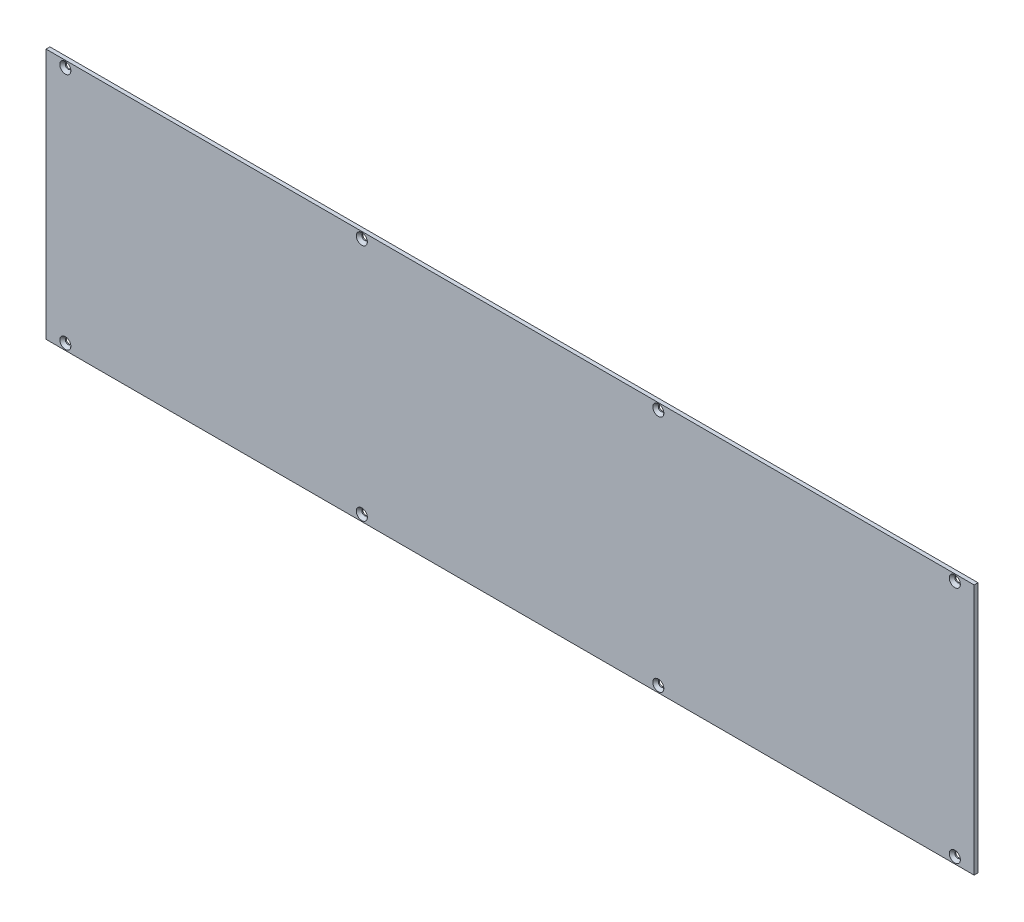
from build123d import *

# Parameters (mm, degrees)
SKETCH_1_W          = 720
SKETCH_1_H          = 195
EXTRUDE_1_DEPTH     = 3
SKETCH_2_R          = 4.3
CUT_EXTRUDE_1_DEPTH = 2.15
DRAFT_1_ANGLE       = 45
SKETCH_3_R          = 2.15
CUT_EXTRUDE_2_DEPTH = 746.942103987
SKETCH_4_R          = 2.15
CUT_EXTRUDE_3_DEPTH = 746.942103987
SKETCH_5_R          = 2.15
CUT_EXTRUDE_4_DEPTH = 746.942103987
SKETCH_6_R          = 2.15
CUT_EXTRUDE_5_DEPTH = 746.942103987
SKETCH_7_R          = 2.15
CUT_EXTRUDE_6_DEPTH = 746.942103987
SKETCH_8_R          = 2.15
CUT_EXTRUDE_7_DEPTH = 746.942103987
SKETCH_9_R          = 2.15
CUT_EXTRUDE_8_DEPTH = 746.942103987
SKETCH_10_R         = 2.15
CUT_EXTRUDE_9_DEPTH = 746.942103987


with BuildPart() as part:
    # Sketch 1 → Extrude 1 (new body)
    with BuildSketch(Plane.XY):
        with Locations((360, 97.5)):
            Rectangle(SKETCH_1_W, SKETCH_1_H)
    extrude(amount=EXTRUDE_1_DEPTH)

    # Sketch 2 → Cut-Extrude 1 (cut)
    with BuildSketch(Plane.XY.offset(3)):
        with Locations((15, 190)):
            Circle(SKETCH_2_R)
        with Locations((245, 190)):
            Circle(SKETCH_2_R)
        with Locations((475, 190)):
            Circle(SKETCH_2_R)
        with Locations((705, 190)):
            Circle(SKETCH_2_R)
        with Locations((15, 5)):
            Circle(SKETCH_2_R)
        with Locations((245, 5)):
            Circle(SKETCH_2_R)
        with Locations((475, 5)):
            Circle(SKETCH_2_R)
        with Locations((705, 5)):
            Circle(SKETCH_2_R)
    extrude(amount=-CUT_EXTRUDE_1_DEPTH, mode=Mode.SUBTRACT)

    # Draft 1
    draft_1_faces = [part.faces().sort_by_distance(p)[0] for p in [
        (10.7, 5, 1.925),
        (240.7, 5, 1.925),
        (470.7, 5, 1.925),
        (700.7, 5, 1.925),
        (700.7, 190, 1.925),
        (470.7, 190, 1.925),
        (240.7, 190, 1.925),
        (10.7, 190, 1.925),
    ]]
    draft(draft_1_faces, Plane.XY.offset(3), DRAFT_1_ANGLE)

    # Sketch 3 → Cut-Extrude 2 (cut, through all)
    with BuildSketch(Plane.XY.offset(0.85)):
        with Locations((15, 5)):
            Circle(SKETCH_3_R)
    extrude(amount=-CUT_EXTRUDE_2_DEPTH, mode=Mode.SUBTRACT)

    # Sketch 4 → Cut-Extrude 3 (cut, through all)
    with BuildSketch(Plane.XY.offset(0.85)):
        with Locations((245, 5)):
            Circle(SKETCH_4_R)
    extrude(amount=-CUT_EXTRUDE_3_DEPTH, mode=Mode.SUBTRACT)

    # Sketch 5 → Cut-Extrude 4 (cut, through all)
    with BuildSketch(Plane.XY.offset(0.85)):
        with Locations((475, 5)):
            Circle(SKETCH_5_R)
    extrude(amount=-CUT_EXTRUDE_4_DEPTH, mode=Mode.SUBTRACT)

    # Sketch 6 → Cut-Extrude 5 (cut, through all)
    with BuildSketch(Plane.XY.offset(0.85)):
        with Locations((705, 5)):
            Circle(SKETCH_6_R)
    extrude(amount=-CUT_EXTRUDE_5_DEPTH, mode=Mode.SUBTRACT)

    # Sketch 7 → Cut-Extrude 6 (cut, through all)
    with BuildSketch(Plane.XY.offset(0.85)):
        with Locations((705, 190)):
            Circle(SKETCH_7_R)
    extrude(amount=-CUT_EXTRUDE_6_DEPTH, mode=Mode.SUBTRACT)

    # Sketch 8 → Cut-Extrude 7 (cut, through all)
    with BuildSketch(Plane.XY.offset(0.85)):
        with Locations((475, 190)):
            Circle(SKETCH_8_R)
    extrude(amount=-CUT_EXTRUDE_7_DEPTH, mode=Mode.SUBTRACT)

    # Sketch 9 → Cut-Extrude 8 (cut, through all)
    with BuildSketch(Plane.XY.offset(0.85)):
        with Locations((245, 190)):
            Circle(SKETCH_9_R)
    extrude(amount=-CUT_EXTRUDE_8_DEPTH, mode=Mode.SUBTRACT)

    # Sketch 10 → Cut-Extrude 9 (cut, through all)
    with BuildSketch(Plane.XY.offset(0.85)):
        with Locations((15, 190)):
            Circle(SKETCH_10_R)
    extrude(amount=-CUT_EXTRUDE_9_DEPTH, mode=Mode.SUBTRACT)


solid = part.part
